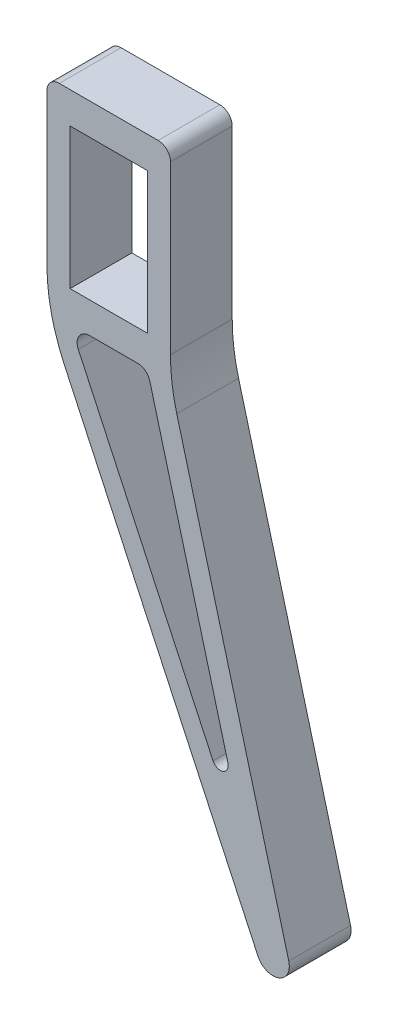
ISO-10303-21;
HEADER;
FILE_DESCRIPTION(('STEP AP214'),'2;1');
FILE_NAME('part.step','',(''),(''),'','','');
FILE_SCHEMA(('AUTOMOTIVE_DESIGN { 1 0 10303 214 1 1 1 1 }'));
ENDSEC;
DATA;
#1=APPLICATION_CONTEXT('core data for automotive mechanical design processes');
#2=APPLICATION_PROTOCOL_DEFINITION('international standard','automotive_design',2000,#1);
#3=PRODUCT_CONTEXT('',#1,'mechanical');
#4=PRODUCT('Part','Part','',(#3));
#5=PRODUCT_RELATED_PRODUCT_CATEGORY('part','',(#4));
#6=PRODUCT_DEFINITION_FORMATION('','',#4);
#7=PRODUCT_DEFINITION_CONTEXT('part definition',#1,'design');
#8=PRODUCT_DEFINITION('design','',#6,#7);
#9=PRODUCT_DEFINITION_SHAPE('','',#8);
#10=(LENGTH_UNIT() NAMED_UNIT(*) SI_UNIT(.MILLI.,.METRE.));
#11=(NAMED_UNIT(*) PLANE_ANGLE_UNIT() SI_UNIT($,.RADIAN.));
#12=(NAMED_UNIT(*) SI_UNIT($,.STERADIAN.) SOLID_ANGLE_UNIT());
#13=UNCERTAINTY_MEASURE_WITH_UNIT(LENGTH_MEASURE(1.E-05),#10,'distance_accuracy_value','');
#14=(GEOMETRIC_REPRESENTATION_CONTEXT(3) GLOBAL_UNCERTAINTY_ASSIGNED_CONTEXT((#13)) GLOBAL_UNIT_ASSIGNED_CONTEXT((#10,
#11,#12)) REPRESENTATION_CONTEXT('',''));
#15=CARTESIAN_POINT('',(0.,0.,0.));
#16=DIRECTION('',(0.,0.,1.));
#17=DIRECTION('',(1.,0.,0.));
#18=AXIS2_PLACEMENT_3D('',#15,#16,#17);
#19=CARTESIAN_POINT('',(18.0649958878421,-65.4863641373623,10.));
#20=DIRECTION('',(0.,0.,1.));
#21=DIRECTION('',(1.,0.,0.));
#22=AXIS2_PLACEMENT_3D('',#19,#20,#21);
#23=CYLINDRICAL_SURFACE('',#22,1.29207622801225);
#24=DIRECTION('',(0.,0.,-1.));
#25=VECTOR('',#24,1.);
#26=CARTESIAN_POINT('',(16.8939771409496,-66.0324191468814,10.));
#27=LINE('',#26,#25);
#28=CARTESIAN_POINT('',(16.8939771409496,-66.0324191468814,10.));
#29=VERTEX_POINT('',#28);
#30=CARTESIAN_POINT('',(16.8939771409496,-66.0324191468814,0.));
#31=VERTEX_POINT('',#30);
#32=EDGE_CURVE('E374',#29,#31,#27,.T.);
#33=ORIENTED_EDGE('',*,*,#32,.F.);
#34=CARTESIAN_POINT('',(18.0649958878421,-65.4863641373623,10.));
#35=DIRECTION('',(0.,0.,-1.));
#36=DIRECTION('',(-1.,0.,0.));
#37=AXIS2_PLACEMENT_3D('',#34,#35,#36);
#38=CIRCLE('',#37,1.29207622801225);
#39=CARTESIAN_POINT('',(19.3130456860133,-65.1519502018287,10.));
#40=VERTEX_POINT('',#39);
#41=EDGE_CURVE('E55',#29,#40,#38,.F.);
#42=ORIENTED_EDGE('',*,*,#41,.T.);
#43=DIRECTION('',(0.,0.,-1.));
#44=VECTOR('',#43,1.);
#45=CARTESIAN_POINT('',(19.3130456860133,-65.1519502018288,10.));
#46=LINE('',#45,#44);
#47=CARTESIAN_POINT('',(19.3130456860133,-65.1519502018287,0.));
#48=VERTEX_POINT('',#47);
#49=EDGE_CURVE('E378',#48,#40,#46,.F.);
#50=ORIENTED_EDGE('',*,*,#49,.F.);
#51=CARTESIAN_POINT('',(18.0649958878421,-65.4863641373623,0.));
#52=DIRECTION('',(0.,0.,-1.));
#53=DIRECTION('',(-1.,0.,0.));
#54=AXIS2_PLACEMENT_3D('',#51,#52,#53);
#55=CIRCLE('',#54,1.29207622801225);
#56=EDGE_CURVE('E12',#48,#31,#55,.T.);
#57=ORIENTED_EDGE('',*,*,#56,.T.);
#58=EDGE_LOOP('',(#33,#42,#50,#57));
#59=FACE_BOUND('',#58,.T.);
#60=ADVANCED_FACE('F46',(#59),#23,.F.);
#61=CARTESIAN_POINT('',(26.5832450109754,-88.6619787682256,0.));
#62=DIRECTION('',(0.,0.,1.));
#63=DIRECTION('',(1.,0.,0.));
#64=AXIS2_PLACEMENT_3D('',#61,#62,#63);
#65=CYLINDRICAL_SURFACE('',#64,2.65870979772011);
#66=DIRECTION('',(0.,0.,1.));
#67=VECTOR('',#66,1.);
#68=CARTESIAN_POINT('',(24.173635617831,-89.7855980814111,0.));
#69=LINE('',#68,#67);
#70=CARTESIAN_POINT('',(24.173635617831,-89.7855980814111,0.));
#71=VERTEX_POINT('',#70);
#72=CARTESIAN_POINT('',(24.173635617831,-89.7855980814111,10.));
#73=VERTEX_POINT('',#72);
#74=EDGE_CURVE('E306',#71,#73,#69,.T.);
#75=ORIENTED_EDGE('',*,*,#74,.F.);
#76=CARTESIAN_POINT('',(26.5832450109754,-88.6619787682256,0.));
#77=DIRECTION('',(0.,0.,-1.));
#78=DIRECTION('',(-1.,0.,0.));
#79=AXIS2_PLACEMENT_3D('',#76,#77,#78);
#80=CIRCLE('',#79,2.65870979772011);
#81=CARTESIAN_POINT('',(29.151361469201,-87.973854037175,0.));
#82=VERTEX_POINT('',#81);
#83=EDGE_CURVE('E314',#82,#71,#80,.T.);
#84=ORIENTED_EDGE('',*,*,#83,.F.);
#85=DIRECTION('',(0.,0.,1.));
#86=VECTOR('',#85,1.);
#87=CARTESIAN_POINT('',(29.151361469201,-87.973854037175,0.));
#88=LINE('',#87,#86);
#89=CARTESIAN_POINT('',(29.151361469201,-87.973854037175,10.));
#90=VERTEX_POINT('',#89);
#91=EDGE_CURVE('E310',#90,#82,#88,.F.);
#92=ORIENTED_EDGE('',*,*,#91,.F.);
#93=CARTESIAN_POINT('',(26.5832450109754,-88.6619787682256,10.));
#94=DIRECTION('',(0.,0.,-1.));
#95=DIRECTION('',(-1.,0.,0.));
#96=AXIS2_PLACEMENT_3D('',#93,#94,#95);
#97=CIRCLE('',#96,2.65870979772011);
#98=EDGE_CURVE('E317',#73,#90,#97,.F.);
#99=ORIENTED_EDGE('',*,*,#98,.F.);
#100=EDGE_LOOP('',(#75,#84,#92,#99));
#101=FACE_BOUND('',#100,.T.);
#102=ADVANCED_FACE('F432',(#101),#65,.T.);
#103=CARTESIAN_POINT('',(10.,-16.5,10.));
#104=DIRECTION('',(-1.,0.,0.));
#105=DIRECTION('',(0.,0.,1.));
#106=AXIS2_PLACEMENT_3D('',#103,#104,#105);
#107=PLANE('',#106);
#108=DIRECTION('',(0.,1.,0.));
#109=VECTOR('',#108,1.);
#110=CARTESIAN_POINT('',(10.,-16.5,0.));
#111=LINE('',#110,#109);
#112=CARTESIAN_POINT('',(10.,-12.5504250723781,0.));
#113=VERTEX_POINT('',#112);
#114=CARTESIAN_POINT('',(10.,14.5,0.));
#115=VERTEX_POINT('',#114);
#116=EDGE_CURVE('E249',#113,#115,#111,.T.);
#117=ORIENTED_EDGE('',*,*,#116,.T.);
#118=DIRECTION('',(0.,0.,-1.));
#119=VECTOR('',#118,1.);
#120=CARTESIAN_POINT('',(10.,14.5,10.));
#121=LINE('',#120,#119);
#122=CARTESIAN_POINT('',(10.,14.5,10.));
#123=VERTEX_POINT('',#122);
#124=EDGE_CURVE('E343',#115,#123,#121,.F.);
#125=ORIENTED_EDGE('',*,*,#124,.T.);
#126=DIRECTION('',(0.,1.,0.));
#127=VECTOR('',#126,1.);
#128=CARTESIAN_POINT('',(10.,-16.5,10.));
#129=LINE('',#128,#127);
#130=CARTESIAN_POINT('',(10.,-12.5504250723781,10.));
#131=VERTEX_POINT('',#130);
#132=EDGE_CURVE('E255',#131,#123,#129,.T.);
#133=ORIENTED_EDGE('',*,*,#132,.F.);
#134=DIRECTION('',(0.,0.,-1.));
#135=VECTOR('',#134,1.);
#136=CARTESIAN_POINT('',(10.,-12.5504250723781,10.));
#137=LINE('',#136,#135);
#138=EDGE_CURVE('E291',#131,#113,#137,.T.);
#139=ORIENTED_EDGE('',*,*,#138,.T.);
#140=EDGE_LOOP('',(#117,#125,#133,#139));
#141=FACE_BOUND('',#140,.T.);
#142=ADVANCED_FACE('F436',(#141),#107,.F.);
#143=CARTESIAN_POINT('',(-10.,16.5,10.));
#144=DIRECTION('',(0.,-1.,0.));
#145=DIRECTION('',(0.,0.,-1.));
#146=AXIS2_PLACEMENT_3D('',#143,#144,#145);
#147=PLANE('',#146);
#148=DIRECTION('',(-1.,0.,0.));
#149=VECTOR('',#148,1.);
#150=CARTESIAN_POINT('',(-10.,16.5,0.));
#151=LINE('',#150,#149);
#152=CARTESIAN_POINT('',(8.,16.5,0.));
#153=VERTEX_POINT('',#152);
#154=CARTESIAN_POINT('',(-8.,16.5,0.));
#155=VERTEX_POINT('',#154);
#156=EDGE_CURVE('E271',#153,#155,#151,.T.);
#157=ORIENTED_EDGE('',*,*,#156,.T.);
#158=DIRECTION('',(0.,0.,-1.));
#159=VECTOR('',#158,1.);
#160=CARTESIAN_POINT('',(-8.,16.5,10.));
#161=LINE('',#160,#159);
#162=CARTESIAN_POINT('',(-8.,16.5,10.));
#163=VERTEX_POINT('',#162);
#164=EDGE_CURVE('E334',#155,#163,#161,.F.);
#165=ORIENTED_EDGE('',*,*,#164,.T.);
#166=DIRECTION('',(-1.,0.,0.));
#167=VECTOR('',#166,1.);
#168=CARTESIAN_POINT('',(-10.,16.5,10.));
#169=LINE('',#168,#167);
#170=CARTESIAN_POINT('',(8.,16.5,10.));
#171=VERTEX_POINT('',#170);
#172=EDGE_CURVE('E259',#171,#163,#169,.T.);
#173=ORIENTED_EDGE('',*,*,#172,.F.);
#174=DIRECTION('',(0.,0.,-1.));
#175=VECTOR('',#174,1.);
#176=CARTESIAN_POINT('',(8.,16.5,10.));
#177=LINE('',#176,#175);
#178=EDGE_CURVE('E330',#171,#153,#177,.T.);
#179=ORIENTED_EDGE('',*,*,#178,.T.);
#180=EDGE_LOOP('',(#157,#165,#173,#179));
#181=FACE_BOUND('',#180,.T.);
#182=ADVANCED_FACE('F442',(#181),#147,.F.);
#183=CARTESIAN_POINT('',(-10.,-16.5,10.));
#184=DIRECTION('',(1.,0.,0.));
#185=DIRECTION('',(0.,0.,-1.));
#186=AXIS2_PLACEMENT_3D('',#183,#184,#185);
#187=PLANE('',#186);
#188=DIRECTION('',(0.,-1.,0.));
#189=VECTOR('',#188,1.);
#190=CARTESIAN_POINT('',(-10.,-16.5,10.));
#191=LINE('',#190,#189);
#192=CARTESIAN_POINT('',(-10.,14.5,10.));
#193=VERTEX_POINT('',#192);
#194=CARTESIAN_POINT('',(-10.,-9.84916012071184,10.));
#195=VERTEX_POINT('',#194);
#196=EDGE_CURVE('E264',#193,#195,#191,.T.);
#197=ORIENTED_EDGE('',*,*,#196,.F.);
#198=DIRECTION('',(0.,0.,-1.));
#199=VECTOR('',#198,1.);
#200=CARTESIAN_POINT('',(-10.,14.5,10.));
#201=LINE('',#200,#199);
#202=CARTESIAN_POINT('',(-10.,14.5,0.));
#203=VERTEX_POINT('',#202);
#204=EDGE_CURVE('E320',#193,#203,#201,.T.);
#205=ORIENTED_EDGE('',*,*,#204,.T.);
#206=DIRECTION('',(0.,-1.,0.));
#207=VECTOR('',#206,1.);
#208=CARTESIAN_POINT('',(-10.,-16.5,0.));
#209=LINE('',#208,#207);
#210=CARTESIAN_POINT('',(-10.,-9.84916012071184,0.));
#211=VERTEX_POINT('',#210);
#212=EDGE_CURVE('E260',#203,#211,#209,.T.);
#213=ORIENTED_EDGE('',*,*,#212,.T.);
#214=DIRECTION('',(0.,0.,-1.));
#215=VECTOR('',#214,1.);
#216=CARTESIAN_POINT('',(-10.,-9.84916012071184,10.));
#217=LINE('',#216,#215);
#218=EDGE_CURVE('E284',#211,#195,#217,.F.);
#219=ORIENTED_EDGE('',*,*,#218,.T.);
#220=EDGE_LOOP('',(#197,#205,#213,#219));
#221=FACE_BOUND('',#220,.T.);
#222=ADVANCED_FACE('F476',(#221),#187,.F.);
#223=CARTESIAN_POINT('',(0.,0.,10.));
#224=DIRECTION('',(0.,0.,-1.));
#225=DIRECTION('',(-1.,0.,0.));
#226=AXIS2_PLACEMENT_3D('',#223,#224,#225);
#227=PLANE('',#226);
#228=DIRECTION('',(0.422618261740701,-0.906307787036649,0.));
#229=VECTOR('',#228,1.);
#230=CARTESIAN_POINT('',(17.3521716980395,-67.0150205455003,10.));
#231=LINE('',#230,#229);
#232=CARTESIAN_POINT('',(-4.92324441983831,-19.2452365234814,10.));
#233=VERTEX_POINT('',#232);
#234=EDGE_CURVE('E393',#233,#29,#231,.T.);
#235=ORIENTED_EDGE('',*,*,#234,.F.);
#236=CARTESIAN_POINT('',(-3.11062884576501,-18.4,10.));
#237=DIRECTION('',(0.,0.,-1.));
#238=DIRECTION('',(-1.,0.,0.));
#239=AXIS2_PLACEMENT_3D('',#236,#237,#238);
#240=CIRCLE('',#239,2.);
#241=CARTESIAN_POINT('',(-3.11062884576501,-16.4,10.));
#242=VERTEX_POINT('',#241);
#243=EDGE_CURVE('E368',#233,#242,#240,.T.);
#244=ORIENTED_EDGE('',*,*,#243,.T.);
#245=DIRECTION('',(-1.,0.,0.));
#246=VECTOR('',#245,1.);
#247=CARTESIAN_POINT('',(-6.25,-16.4,10.));
#248=LINE('',#247,#246);
#249=CARTESIAN_POINT('',(4.71534602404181,-16.4,10.));
#250=VERTEX_POINT('',#249);
#251=EDGE_CURVE('E400',#250,#242,#248,.T.);
#252=ORIENTED_EDGE('',*,*,#251,.F.);
#253=CARTESIAN_POINT('',(4.71534602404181,-18.4,10.));
#254=DIRECTION('',(0.,0.,-1.));
#255=DIRECTION('',(-1.,0.,0.));
#256=AXIS2_PLACEMENT_3D('',#253,#254,#255);
#257=CIRCLE('',#256,2.);
#258=CARTESIAN_POINT('',(6.64719767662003,-17.8823619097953,10.));
#259=VERTEX_POINT('',#258);
#260=EDGE_CURVE('E361',#250,#259,#257,.T.);
#261=ORIENTED_EDGE('',*,*,#260,.T.);
#262=DIRECTION('',(-0.258819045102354,0.965925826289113,0.));
#263=VECTOR('',#262,1.);
#264=CARTESIAN_POINT('',(6.25,-16.4,10.));
#265=LINE('',#264,#263);
#266=EDGE_CURVE('E216',#40,#259,#265,.T.);
#267=ORIENTED_EDGE('',*,*,#266,.F.);
#268=ORIENTED_EDGE('',*,*,#41,.F.);
#269=EDGE_LOOP('',(#235,#244,#252,#261,#267,#268));
#270=FACE_BOUND('',#269,.T.);
#271=DIRECTION('',(-1.,0.,0.));
#272=VECTOR('',#271,1.);
#273=CARTESIAN_POINT('',(-6.25,11.4,10.));
#274=LINE('',#273,#272);
#275=CARTESIAN_POINT('',(6.25,11.4,10.));
#276=VERTEX_POINT('',#275);
#277=CARTESIAN_POINT('',(-6.25,11.4,10.));
#278=VERTEX_POINT('',#277);
#279=EDGE_CURVE('E225',#276,#278,#274,.T.);
#280=ORIENTED_EDGE('',*,*,#279,.F.);
#281=DIRECTION('',(0.,1.,0.));
#282=VECTOR('',#281,1.);
#283=CARTESIAN_POINT('',(6.25,-11.4,10.));
#284=LINE('',#283,#282);
#285=CARTESIAN_POINT('',(6.25,-11.4,10.));
#286=VERTEX_POINT('',#285);
#287=EDGE_CURVE('E188',#286,#276,#284,.T.);
#288=ORIENTED_EDGE('',*,*,#287,.F.);
#289=DIRECTION('',(1.,0.,0.));
#290=VECTOR('',#289,1.);
#291=CARTESIAN_POINT('',(-6.25,-11.4,10.));
#292=LINE('',#291,#290);
#293=CARTESIAN_POINT('',(-6.25,-11.4,10.));
#294=VERTEX_POINT('',#293);
#295=EDGE_CURVE('E209',#294,#286,#292,.T.);
#296=ORIENTED_EDGE('',*,*,#295,.F.);
#297=DIRECTION('',(0.,-1.,0.));
#298=VECTOR('',#297,1.);
#299=CARTESIAN_POINT('',(-6.25,-11.4,10.));
#300=LINE('',#299,#298);
#301=EDGE_CURVE('E213',#278,#294,#300,.T.);
#302=ORIENTED_EDGE('',*,*,#301,.F.);
#303=EDGE_LOOP('',(#280,#288,#296,#302));
#304=FACE_BOUND('',#303,.T.);
#305=ORIENTED_EDGE('',*,*,#172,.T.);
#306=CARTESIAN_POINT('',(-8.,14.5,10.));
#307=DIRECTION('',(0.,0.,-1.));
#308=DIRECTION('',(-1.,0.,0.));
#309=AXIS2_PLACEMENT_3D('',#306,#307,#308);
#310=CIRCLE('',#309,2.);
#311=EDGE_CURVE('E340',#163,#193,#310,.F.);
#312=ORIENTED_EDGE('',*,*,#311,.T.);
#313=ORIENTED_EDGE('',*,*,#196,.T.);
#314=CARTESIAN_POINT('',(20.,-9.84916012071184,10.));
#315=DIRECTION('',(0.,0.,-1.));
#316=DIRECTION('',(-1.,0.,0.));
#317=AXIS2_PLACEMENT_3D('',#314,#315,#316);
#318=CIRCLE('',#317,30.);
#319=CARTESIAN_POINT('',(-7.18923361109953,-22.5277079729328,10.));
#320=VERTEX_POINT('',#319);
#321=EDGE_CURVE('E288',#195,#320,#318,.F.);
#322=ORIENTED_EDGE('',*,*,#321,.T.);
#323=DIRECTION('',(0.422618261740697,-0.906307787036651,0.));
#324=VECTOR('',#323,1.);
#325=CARTESIAN_POINT('',(-10.,-16.5,10.));
#326=LINE('',#325,#324);
#327=EDGE_CURVE('E235',#320,#73,#326,.T.);
#328=ORIENTED_EDGE('',*,*,#327,.T.);
#329=ORIENTED_EDGE('',*,*,#98,.T.);
#330=DIRECTION('',(-0.258819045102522,0.965925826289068,0.));
#331=VECTOR('',#330,1.);
#332=CARTESIAN_POINT('',(29.8394862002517,-90.5419704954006,10.));
#333=LINE('',#332,#331);
#334=CARTESIAN_POINT('',(11.0222252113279,-20.3149964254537,10.));
#335=VERTEX_POINT('',#334);
#336=EDGE_CURVE('E246',#90,#335,#333,.T.);
#337=ORIENTED_EDGE('',*,*,#336,.T.);
#338=CARTESIAN_POINT('',(40.,-12.5504250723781,10.));
#339=DIRECTION('',(0.,0.,-1.));
#340=DIRECTION('',(-1.,0.,0.));
#341=AXIS2_PLACEMENT_3D('',#338,#339,#340);
#342=CIRCLE('',#341,30.);
#343=EDGE_CURVE('E303',#335,#131,#342,.T.);
#344=ORIENTED_EDGE('',*,*,#343,.T.);
#345=ORIENTED_EDGE('',*,*,#132,.T.);
#346=CARTESIAN_POINT('',(8.,14.5,10.));
#347=DIRECTION('',(0.,0.,-1.));
#348=DIRECTION('',(-1.,0.,0.));
#349=AXIS2_PLACEMENT_3D('',#346,#347,#348);
#350=CIRCLE('',#349,2.);
#351=EDGE_CURVE('E337',#123,#171,#350,.F.);
#352=ORIENTED_EDGE('',*,*,#351,.T.);
#353=EDGE_LOOP('',(#305,#312,#313,#322,#328,#329,#337,#344,#345,#352));
#354=FACE_BOUND('',#353,.T.);
#355=ADVANCED_FACE('F387',(#270,#304,#354),#227,.F.);
#356=CARTESIAN_POINT('',(0.,0.,0.));
#357=DIRECTION('',(0.,0.,-1.));
#358=DIRECTION('',(-1.,0.,0.));
#359=AXIS2_PLACEMENT_3D('',#356,#357,#358);
#360=PLANE('',#359);
#361=ORIENTED_EDGE('',*,*,#56,.F.);
#362=DIRECTION('',(-0.258819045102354,0.965925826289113,0.));
#363=VECTOR('',#362,1.);
#364=CARTESIAN_POINT('',(6.25,-16.4,0.));
#365=LINE('',#364,#363);
#366=CARTESIAN_POINT('',(6.64719767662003,-17.8823619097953,0.));
#367=VERTEX_POINT('',#366);
#368=EDGE_CURVE('E226',#48,#367,#365,.T.);
#369=ORIENTED_EDGE('',*,*,#368,.T.);
#370=CARTESIAN_POINT('',(4.71534602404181,-18.4,0.));
#371=DIRECTION('',(0.,0.,-1.));
#372=DIRECTION('',(-1.,0.,0.));
#373=AXIS2_PLACEMENT_3D('',#370,#371,#372);
#374=CIRCLE('',#373,2.);
#375=CARTESIAN_POINT('',(4.71534602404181,-16.4,0.));
#376=VERTEX_POINT('',#375);
#377=EDGE_CURVE('E365',#367,#376,#374,.F.);
#378=ORIENTED_EDGE('',*,*,#377,.T.);
#379=DIRECTION('',(-1.,0.,0.));
#380=VECTOR('',#379,1.);
#381=CARTESIAN_POINT('',(-6.25,-16.4,0.));
#382=LINE('',#381,#380);
#383=CARTESIAN_POINT('',(-3.11062884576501,-16.4,0.));
#384=VERTEX_POINT('',#383);
#385=EDGE_CURVE('E392',#376,#384,#382,.T.);
#386=ORIENTED_EDGE('',*,*,#385,.T.);
#387=CARTESIAN_POINT('',(-3.11062884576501,-18.4,0.));
#388=DIRECTION('',(0.,0.,-1.));
#389=DIRECTION('',(-1.,0.,0.));
#390=AXIS2_PLACEMENT_3D('',#387,#388,#389);
#391=CIRCLE('',#390,2.);
#392=CARTESIAN_POINT('',(-4.92324441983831,-19.2452365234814,0.));
#393=VERTEX_POINT('',#392);
#394=EDGE_CURVE('E371',#384,#393,#391,.F.);
#395=ORIENTED_EDGE('',*,*,#394,.T.);
#396=DIRECTION('',(0.422618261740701,-0.906307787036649,0.));
#397=VECTOR('',#396,1.);
#398=CARTESIAN_POINT('',(17.3521716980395,-67.0150205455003,0.));
#399=LINE('',#398,#397);
#400=EDGE_CURVE('E397',#393,#31,#399,.T.);
#401=ORIENTED_EDGE('',*,*,#400,.T.);
#402=EDGE_LOOP('',(#361,#369,#378,#386,#395,#401));
#403=FACE_BOUND('',#402,.T.);
#404=DIRECTION('',(0.,1.,0.));
#405=VECTOR('',#404,1.);
#406=CARTESIAN_POINT('',(6.25,-11.4,0.));
#407=LINE('',#406,#405);
#408=CARTESIAN_POINT('',(6.25,-11.4,0.));
#409=VERTEX_POINT('',#408);
#410=CARTESIAN_POINT('',(6.25,11.4,0.));
#411=VERTEX_POINT('',#410);
#412=EDGE_CURVE('E185',#409,#411,#407,.T.);
#413=ORIENTED_EDGE('',*,*,#412,.T.);
#414=DIRECTION('',(-1.,0.,0.));
#415=VECTOR('',#414,1.);
#416=CARTESIAN_POINT('',(-6.25,11.4,0.));
#417=LINE('',#416,#415);
#418=CARTESIAN_POINT('',(-6.25,11.4,0.));
#419=VERTEX_POINT('',#418);
#420=EDGE_CURVE('E198',#411,#419,#417,.T.);
#421=ORIENTED_EDGE('',*,*,#420,.T.);
#422=DIRECTION('',(0.,-1.,0.));
#423=VECTOR('',#422,1.);
#424=CARTESIAN_POINT('',(-6.25,-11.4,0.));
#425=LINE('',#424,#423);
#426=CARTESIAN_POINT('',(-6.25,-11.4,0.));
#427=VERTEX_POINT('',#426);
#428=EDGE_CURVE('E203',#419,#427,#425,.T.);
#429=ORIENTED_EDGE('',*,*,#428,.T.);
#430=DIRECTION('',(1.,0.,0.));
#431=VECTOR('',#430,1.);
#432=CARTESIAN_POINT('',(-6.25,-11.4,0.));
#433=LINE('',#432,#431);
#434=EDGE_CURVE('E194',#427,#409,#433,.T.);
#435=ORIENTED_EDGE('',*,*,#434,.T.);
#436=EDGE_LOOP('',(#413,#421,#429,#435));
#437=FACE_BOUND('',#436,.T.);
#438=ORIENTED_EDGE('',*,*,#212,.F.);
#439=CARTESIAN_POINT('',(-8.,14.5,0.));
#440=DIRECTION('',(0.,0.,-1.));
#441=DIRECTION('',(-1.,0.,0.));
#442=AXIS2_PLACEMENT_3D('',#439,#440,#441);
#443=CIRCLE('',#442,2.);
#444=EDGE_CURVE('E327',#203,#155,#443,.T.);
#445=ORIENTED_EDGE('',*,*,#444,.T.);
#446=ORIENTED_EDGE('',*,*,#156,.F.);
#447=CARTESIAN_POINT('',(8.,14.5,0.));
#448=DIRECTION('',(0.,0.,-1.));
#449=DIRECTION('',(-1.,0.,0.));
#450=AXIS2_PLACEMENT_3D('',#447,#448,#449);
#451=CIRCLE('',#450,2.);
#452=EDGE_CURVE('E324',#153,#115,#451,.T.);
#453=ORIENTED_EDGE('',*,*,#452,.T.);
#454=ORIENTED_EDGE('',*,*,#116,.F.);
#455=CARTESIAN_POINT('',(40.,-12.5504250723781,0.));
#456=DIRECTION('',(0.,0.,-1.));
#457=DIRECTION('',(-1.,0.,0.));
#458=AXIS2_PLACEMENT_3D('',#455,#456,#457);
#459=CIRCLE('',#458,30.);
#460=CARTESIAN_POINT('',(11.0222252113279,-20.3149964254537,0.));
#461=VERTEX_POINT('',#460);
#462=EDGE_CURVE('E299',#113,#461,#459,.F.);
#463=ORIENTED_EDGE('',*,*,#462,.T.);
#464=DIRECTION('',(-0.258819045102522,0.965925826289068,0.));
#465=VECTOR('',#464,1.);
#466=CARTESIAN_POINT('',(29.8394862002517,-90.5419704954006,0.));
#467=LINE('',#466,#465);
#468=EDGE_CURVE('E245',#82,#461,#467,.T.);
#469=ORIENTED_EDGE('',*,*,#468,.F.);
#470=ORIENTED_EDGE('',*,*,#83,.T.);
#471=DIRECTION('',(0.422618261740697,-0.906307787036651,0.));
#472=VECTOR('',#471,1.);
#473=CARTESIAN_POINT('',(-10.,-16.5,0.));
#474=LINE('',#473,#472);
#475=CARTESIAN_POINT('',(-7.18923361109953,-22.5277079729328,0.));
#476=VERTEX_POINT('',#475);
#477=EDGE_CURVE('E241',#476,#71,#474,.T.);
#478=ORIENTED_EDGE('',*,*,#477,.F.);
#479=CARTESIAN_POINT('',(20.,-9.84916012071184,0.));
#480=DIRECTION('',(0.,0.,-1.));
#481=DIRECTION('',(-1.,0.,0.));
#482=AXIS2_PLACEMENT_3D('',#479,#480,#481);
#483=CIRCLE('',#482,30.);
#484=EDGE_CURVE('E280',#476,#211,#483,.T.);
#485=ORIENTED_EDGE('',*,*,#484,.T.);
#486=EDGE_LOOP('',(#438,#445,#446,#453,#454,#463,#469,#470,#478,#485));
#487=FACE_BOUND('',#486,.T.);
#488=ADVANCED_FACE('F205',(#403,#437,#487),#360,.T.);
#489=CARTESIAN_POINT('',(29.8394862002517,-90.5419704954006,0.));
#490=DIRECTION('',(0.965925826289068,0.258819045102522,0.));
#491=DIRECTION('',(-0.258819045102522,0.965925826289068,0.));
#492=AXIS2_PLACEMENT_3D('',#489,#490,#491);
#493=PLANE('',#492);
#494=ORIENTED_EDGE('',*,*,#336,.F.);
#495=ORIENTED_EDGE('',*,*,#91,.T.);
#496=ORIENTED_EDGE('',*,*,#468,.T.);
#497=DIRECTION('',(0.,0.,-1.));
#498=VECTOR('',#497,1.);
#499=CARTESIAN_POINT('',(11.0222252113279,-20.3149964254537,0.));
#500=LINE('',#499,#498);
#501=EDGE_CURVE('E295',#461,#335,#500,.F.);
#502=ORIENTED_EDGE('',*,*,#501,.T.);
#503=EDGE_LOOP('',(#494,#495,#496,#502));
#504=FACE_BOUND('',#503,.T.);
#505=ADVANCED_FACE('F492',(#504),#493,.T.);
#506=CARTESIAN_POINT('',(-10.,-16.5,0.));
#507=DIRECTION('',(-0.906307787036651,-0.422618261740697,0.));
#508=DIRECTION('',(0.422618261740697,-0.906307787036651,0.));
#509=AXIS2_PLACEMENT_3D('',#506,#507,#508);
#510=PLANE('',#509);
#511=ORIENTED_EDGE('',*,*,#477,.T.);
#512=ORIENTED_EDGE('',*,*,#74,.T.);
#513=ORIENTED_EDGE('',*,*,#327,.F.);
#514=DIRECTION('',(0.,0.,-1.));
#515=VECTOR('',#514,1.);
#516=CARTESIAN_POINT('',(-7.18923361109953,-22.5277079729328,0.));
#517=LINE('',#516,#515);
#518=EDGE_CURVE('E267',#320,#476,#517,.T.);
#519=ORIENTED_EDGE('',*,*,#518,.T.);
#520=EDGE_LOOP('',(#511,#512,#513,#519));
#521=FACE_BOUND('',#520,.T.);
#522=ADVANCED_FACE('F485',(#521),#510,.T.);
#523=CARTESIAN_POINT('',(20.,-9.84916012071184,0.));
#524=DIRECTION('',(0.,0.,1.));
#525=DIRECTION('',(1.,0.,0.));
#526=AXIS2_PLACEMENT_3D('',#523,#524,#525);
#527=CYLINDRICAL_SURFACE('',#526,30.);
#528=ORIENTED_EDGE('',*,*,#321,.F.);
#529=ORIENTED_EDGE('',*,*,#218,.F.);
#530=ORIENTED_EDGE('',*,*,#484,.F.);
#531=ORIENTED_EDGE('',*,*,#518,.F.);
#532=EDGE_LOOP('',(#528,#529,#530,#531));
#533=FACE_BOUND('',#532,.T.);
#534=ADVANCED_FACE('F482',(#533),#527,.T.);
#535=CARTESIAN_POINT('',(40.,-12.5504250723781,10.));
#536=DIRECTION('',(0.,0.,-1.));
#537=DIRECTION('',(-1.,0.,0.));
#538=AXIS2_PLACEMENT_3D('',#535,#536,#537);
#539=CYLINDRICAL_SURFACE('',#538,30.);
#540=ORIENTED_EDGE('',*,*,#343,.F.);
#541=ORIENTED_EDGE('',*,*,#501,.F.);
#542=ORIENTED_EDGE('',*,*,#462,.F.);
#543=ORIENTED_EDGE('',*,*,#138,.F.);
#544=EDGE_LOOP('',(#540,#541,#542,#543));
#545=FACE_BOUND('',#544,.T.);
#546=ADVANCED_FACE('F451',(#545),#539,.F.);
#547=CARTESIAN_POINT('',(6.25,-11.4,0.));
#548=DIRECTION('',(1.,0.,0.));
#549=DIRECTION('',(0.,0.,-1.));
#550=AXIS2_PLACEMENT_3D('',#547,#548,#549);
#551=PLANE('',#550);
#552=ORIENTED_EDGE('',*,*,#287,.T.);
#553=DIRECTION('',(0.,0.,1.));
#554=VECTOR('',#553,1.);
#555=CARTESIAN_POINT('',(6.25,11.4,0.));
#556=LINE('',#555,#554);
#557=EDGE_CURVE('E181',#411,#276,#556,.T.);
#558=ORIENTED_EDGE('',*,*,#557,.F.);
#559=ORIENTED_EDGE('',*,*,#412,.F.);
#560=DIRECTION('',(0.,0.,1.));
#561=VECTOR('',#560,1.);
#562=CARTESIAN_POINT('',(6.25,-11.4,0.));
#563=LINE('',#562,#561);
#564=EDGE_CURVE('E232',#409,#286,#563,.T.);
#565=ORIENTED_EDGE('',*,*,#564,.T.);
#566=EDGE_LOOP('',(#552,#558,#559,#565));
#567=FACE_BOUND('',#566,.T.);
#568=ADVANCED_FACE('F183',(#567),#551,.F.);
#569=CARTESIAN_POINT('',(-6.25,-11.4,0.));
#570=DIRECTION('',(0.,-1.,0.));
#571=DIRECTION('',(0.,0.,-1.));
#572=AXIS2_PLACEMENT_3D('',#569,#570,#571);
#573=PLANE('',#572);
#574=ORIENTED_EDGE('',*,*,#295,.T.);
#575=ORIENTED_EDGE('',*,*,#564,.F.);
#576=ORIENTED_EDGE('',*,*,#434,.F.);
#577=DIRECTION('',(0.,0.,1.));
#578=VECTOR('',#577,1.);
#579=CARTESIAN_POINT('',(-6.25,-11.4,0.));
#580=LINE('',#579,#578);
#581=EDGE_CURVE('E236',#427,#294,#580,.T.);
#582=ORIENTED_EDGE('',*,*,#581,.T.);
#583=EDGE_LOOP('',(#574,#575,#576,#582));
#584=FACE_BOUND('',#583,.T.);
#585=ADVANCED_FACE('F520',(#584),#573,.F.);
#586=CARTESIAN_POINT('',(-6.25,-11.4,0.));
#587=DIRECTION('',(-1.,0.,0.));
#588=DIRECTION('',(0.,0.,1.));
#589=AXIS2_PLACEMENT_3D('',#586,#587,#588);
#590=PLANE('',#589);
#591=ORIENTED_EDGE('',*,*,#301,.T.);
#592=ORIENTED_EDGE('',*,*,#581,.F.);
#593=ORIENTED_EDGE('',*,*,#428,.F.);
#594=DIRECTION('',(0.,0.,1.));
#595=VECTOR('',#594,1.);
#596=CARTESIAN_POINT('',(-6.25,11.4,0.));
#597=LINE('',#596,#595);
#598=EDGE_CURVE('E193',#419,#278,#597,.T.);
#599=ORIENTED_EDGE('',*,*,#598,.T.);
#600=EDGE_LOOP('',(#591,#592,#593,#599));
#601=FACE_BOUND('',#600,.T.);
#602=ADVANCED_FACE('F523',(#601),#590,.F.);
#603=CARTESIAN_POINT('',(-6.25,11.4,0.));
#604=DIRECTION('',(0.,1.,0.));
#605=DIRECTION('',(0.,0.,1.));
#606=AXIS2_PLACEMENT_3D('',#603,#604,#605);
#607=PLANE('',#606);
#608=ORIENTED_EDGE('',*,*,#279,.T.);
#609=ORIENTED_EDGE('',*,*,#598,.F.);
#610=ORIENTED_EDGE('',*,*,#420,.F.);
#611=ORIENTED_EDGE('',*,*,#557,.T.);
#612=EDGE_LOOP('',(#608,#609,#610,#611));
#613=FACE_BOUND('',#612,.T.);
#614=ADVANCED_FACE('F199',(#613),#607,.F.);
#615=CARTESIAN_POINT('',(-8.,14.5,10.));
#616=DIRECTION('',(0.,0.,-1.));
#617=DIRECTION('',(-1.,0.,0.));
#618=AXIS2_PLACEMENT_3D('',#615,#616,#617);
#619=CYLINDRICAL_SURFACE('',#618,2.);
#620=ORIENTED_EDGE('',*,*,#311,.F.);
#621=ORIENTED_EDGE('',*,*,#164,.F.);
#622=ORIENTED_EDGE('',*,*,#444,.F.);
#623=ORIENTED_EDGE('',*,*,#204,.F.);
#624=EDGE_LOOP('',(#620,#621,#622,#623));
#625=FACE_BOUND('',#624,.T.);
#626=ADVANCED_FACE('F453',(#625),#619,.T.);
#627=CARTESIAN_POINT('',(8.,14.5,10.));
#628=DIRECTION('',(0.,0.,-1.));
#629=DIRECTION('',(-1.,0.,0.));
#630=AXIS2_PLACEMENT_3D('',#627,#628,#629);
#631=CYLINDRICAL_SURFACE('',#630,2.);
#632=ORIENTED_EDGE('',*,*,#351,.F.);
#633=ORIENTED_EDGE('',*,*,#124,.F.);
#634=ORIENTED_EDGE('',*,*,#452,.F.);
#635=ORIENTED_EDGE('',*,*,#178,.F.);
#636=EDGE_LOOP('',(#632,#633,#634,#635));
#637=FACE_BOUND('',#636,.T.);
#638=ADVANCED_FACE('F455',(#637),#631,.T.);
#639=CARTESIAN_POINT('',(-6.25,-16.4,0.));
#640=DIRECTION('',(0.,1.,0.));
#641=DIRECTION('',(0.,0.,1.));
#642=AXIS2_PLACEMENT_3D('',#639,#640,#641);
#643=PLANE('',#642);
#644=ORIENTED_EDGE('',*,*,#385,.F.);
#645=DIRECTION('',(0.,0.,1.));
#646=VECTOR('',#645,1.);
#647=CARTESIAN_POINT('',(4.71534602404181,-16.4,10.));
#648=LINE('',#647,#646);
#649=EDGE_CURVE('E349',#376,#250,#648,.T.);
#650=ORIENTED_EDGE('',*,*,#649,.T.);
#651=ORIENTED_EDGE('',*,*,#251,.T.);
#652=DIRECTION('',(0.,0.,1.));
#653=VECTOR('',#652,1.);
#654=CARTESIAN_POINT('',(-3.11062884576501,-16.4,0.));
#655=LINE('',#654,#653);
#656=EDGE_CURVE('E346',#242,#384,#655,.F.);
#657=ORIENTED_EDGE('',*,*,#656,.T.);
#658=EDGE_LOOP('',(#644,#650,#651,#657));
#659=FACE_BOUND('',#658,.T.);
#660=ADVANCED_FACE('F418',(#659),#643,.F.);
#661=CARTESIAN_POINT('',(6.25,-16.4,0.));
#662=DIRECTION('',(0.965925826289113,0.258819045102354,0.));
#663=DIRECTION('',(-0.258819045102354,0.965925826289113,0.));
#664=AXIS2_PLACEMENT_3D('',#661,#662,#663);
#665=PLANE('',#664);
#666=ORIENTED_EDGE('',*,*,#368,.F.);
#667=ORIENTED_EDGE('',*,*,#49,.T.);
#668=ORIENTED_EDGE('',*,*,#266,.T.);
#669=DIRECTION('',(0.,0.,1.));
#670=VECTOR('',#669,1.);
#671=CARTESIAN_POINT('',(6.64719767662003,-17.8823619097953,0.));
#672=LINE('',#671,#670);
#673=EDGE_CURVE('E353',#259,#367,#672,.F.);
#674=ORIENTED_EDGE('',*,*,#673,.T.);
#675=EDGE_LOOP('',(#666,#667,#668,#674));
#676=FACE_BOUND('',#675,.T.);
#677=ADVANCED_FACE('F384',(#676),#665,.F.);
#678=CARTESIAN_POINT('',(17.3521716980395,-67.0150205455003,0.));
#679=DIRECTION('',(-0.906307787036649,-0.422618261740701,0.));
#680=DIRECTION('',(0.422618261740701,-0.906307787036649,0.));
#681=AXIS2_PLACEMENT_3D('',#678,#679,#680);
#682=PLANE('',#681);
#683=ORIENTED_EDGE('',*,*,#234,.T.);
#684=ORIENTED_EDGE('',*,*,#32,.T.);
#685=ORIENTED_EDGE('',*,*,#400,.F.);
#686=DIRECTION('',(0.,0.,1.));
#687=VECTOR('',#686,1.);
#688=CARTESIAN_POINT('',(-4.92324441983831,-19.2452365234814,10.));
#689=LINE('',#688,#687);
#690=EDGE_CURVE('E357',#393,#233,#689,.T.);
#691=ORIENTED_EDGE('',*,*,#690,.T.);
#692=EDGE_LOOP('',(#683,#684,#685,#691));
#693=FACE_BOUND('',#692,.T.);
#694=ADVANCED_FACE('F412',(#693),#682,.F.);
#695=CARTESIAN_POINT('',(4.71534602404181,-18.4,0.));
#696=DIRECTION('',(0.,0.,-1.));
#697=DIRECTION('',(-1.,0.,0.));
#698=AXIS2_PLACEMENT_3D('',#695,#696,#697);
#699=CYLINDRICAL_SURFACE('',#698,2.);
#700=ORIENTED_EDGE('',*,*,#377,.F.);
#701=ORIENTED_EDGE('',*,*,#673,.F.);
#702=ORIENTED_EDGE('',*,*,#260,.F.);
#703=ORIENTED_EDGE('',*,*,#649,.F.);
#704=EDGE_LOOP('',(#700,#701,#702,#703));
#705=FACE_BOUND('',#704,.T.);
#706=ADVANCED_FACE('F422',(#705),#699,.F.);
#707=CARTESIAN_POINT('',(-3.11062884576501,-18.4,0.));
#708=DIRECTION('',(0.,0.,-1.));
#709=DIRECTION('',(-1.,0.,0.));
#710=AXIS2_PLACEMENT_3D('',#707,#708,#709);
#711=CYLINDRICAL_SURFACE('',#710,2.);
#712=ORIENTED_EDGE('',*,*,#394,.F.);
#713=ORIENTED_EDGE('',*,*,#656,.F.);
#714=ORIENTED_EDGE('',*,*,#243,.F.);
#715=ORIENTED_EDGE('',*,*,#690,.F.);
#716=EDGE_LOOP('',(#712,#713,#714,#715));
#717=FACE_BOUND('',#716,.T.);
#718=ADVANCED_FACE('F414',(#717),#711,.F.);
#719=CLOSED_SHELL('',(#60,#102,#142,#182,#222,#355,#488,#505,#522,#534,#546,#568,#585,#602,#614,
#626,#638,#660,#677,#694,#706,#718));
#720=MANIFOLD_SOLID_BREP('B2',#719);
#721=ADVANCED_BREP_SHAPE_REPRESENTATION('',(#18,#720),#14);
#722=SHAPE_DEFINITION_REPRESENTATION(#9,#721);
ENDSEC;
END-ISO-10303-21;
